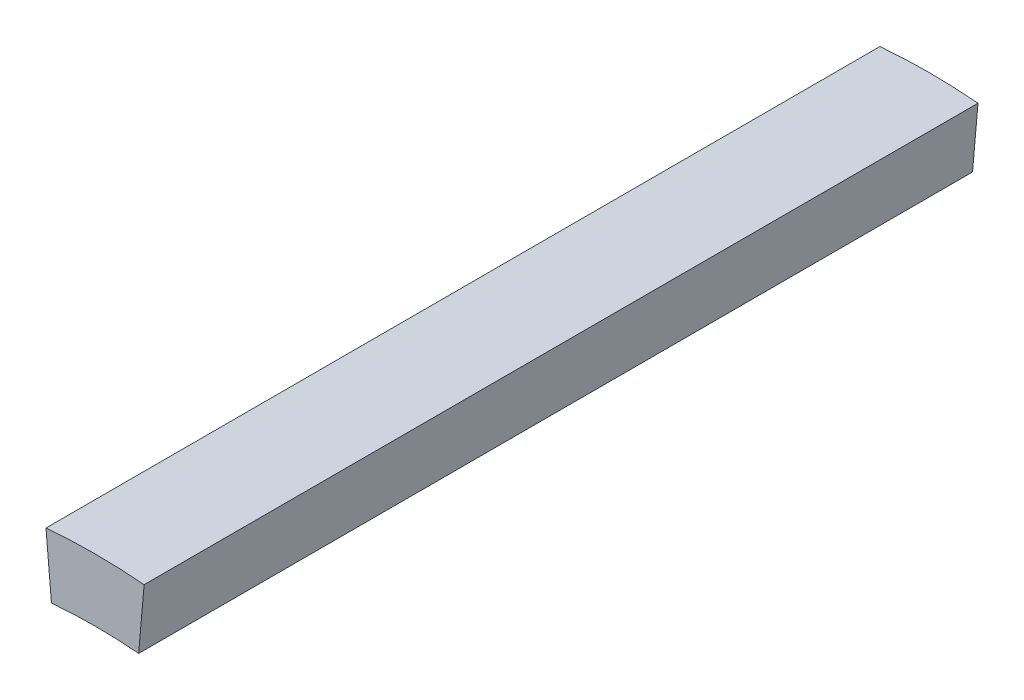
from build123d import *

# Parameters (mm, degrees)
BOSS_EXTRU_1_DEPTH = 10


with BuildPart() as part:
    # Esquisse1 → Boss.-Extru.1 (new body)
    with BuildSketch(Plane.XY):
        with BuildLine():
            Line((-0.588301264, 6.724314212), (-0.522934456, 5.977168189))
            ThreePointArc((-0.522934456, 5.977168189), (0, 6), (0.522934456, 5.977168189))
            Line((0.522934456, 5.977168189), (0.588301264, 6.724314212))
            ThreePointArc((0.588301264, 6.724314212), (0, 6.75), (-0.588301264, 6.724314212))
        make_face()
    extrude(amount=BOSS_EXTRU_1_DEPTH)


solid = part.part
